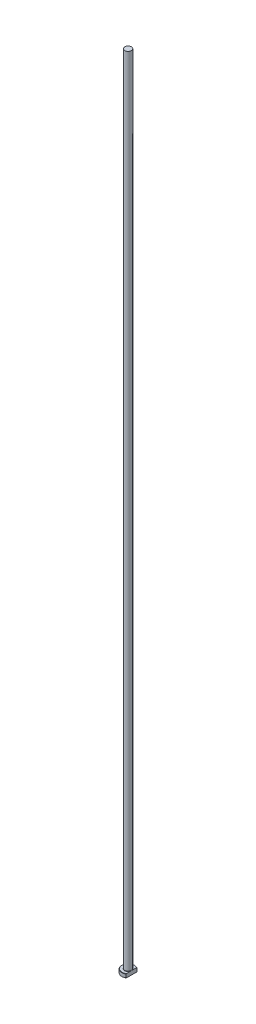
ISO-10303-21;
HEADER;
FILE_DESCRIPTION(('STEP AP214'),'2;1');
FILE_NAME('part.step','',(''),(''),'','','');
FILE_SCHEMA(('AUTOMOTIVE_DESIGN { 1 0 10303 214 1 1 1 1 }'));
ENDSEC;
DATA;
#1=APPLICATION_CONTEXT('core data for automotive mechanical design processes');
#2=APPLICATION_PROTOCOL_DEFINITION('international standard','automotive_design',2000,#1);
#3=PRODUCT_CONTEXT('',#1,'mechanical');
#4=PRODUCT('Part','Part','',(#3));
#5=PRODUCT_RELATED_PRODUCT_CATEGORY('part','',(#4));
#6=PRODUCT_DEFINITION_FORMATION('','',#4);
#7=PRODUCT_DEFINITION_CONTEXT('part definition',#1,'design');
#8=PRODUCT_DEFINITION('design','',#6,#7);
#9=PRODUCT_DEFINITION_SHAPE('','',#8);
#10=(LENGTH_UNIT() NAMED_UNIT(*) SI_UNIT(.MILLI.,.METRE.));
#11=(NAMED_UNIT(*) PLANE_ANGLE_UNIT() SI_UNIT($,.RADIAN.));
#12=(NAMED_UNIT(*) SI_UNIT($,.STERADIAN.) SOLID_ANGLE_UNIT());
#13=UNCERTAINTY_MEASURE_WITH_UNIT(LENGTH_MEASURE(1.E-05),#10,'distance_accuracy_value','');
#14=(GEOMETRIC_REPRESENTATION_CONTEXT(3) GLOBAL_UNCERTAINTY_ASSIGNED_CONTEXT((#13)) GLOBAL_UNIT_ASSIGNED_CONTEXT((#10,
#11,#12)) REPRESENTATION_CONTEXT('',''));
#15=CARTESIAN_POINT('',(0.,0.,0.));
#16=DIRECTION('',(0.,0.,1.));
#17=DIRECTION('',(1.,0.,0.));
#18=AXIS2_PLACEMENT_3D('',#15,#16,#17);
#19=CARTESIAN_POINT('',(0.,0.,0.));
#20=DIRECTION('',(0.,-1.,0.));
#21=DIRECTION('',(0.,0.,-1.));
#22=AXIS2_PLACEMENT_3D('',#19,#20,#21);
#23=PLANE('',#22);
#24=CARTESIAN_POINT('',(0.,0.,0.));
#25=DIRECTION('',(0.,-1.,0.));
#26=DIRECTION('',(0.,0.,-1.));
#27=AXIS2_PLACEMENT_3D('',#24,#25,#26);
#28=CIRCLE('',#27,4.79999999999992);
#29=CARTESIAN_POINT('',(2.59999999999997,0.,4.03484820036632));
#30=VERTEX_POINT('',#29);
#31=CARTESIAN_POINT('',(2.59999999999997,0.,-4.03484820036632));
#32=VERTEX_POINT('',#31);
#33=EDGE_CURVE('E98',#30,#32,#28,.T.);
#34=ORIENTED_EDGE('',*,*,#33,.T.);
#35=DIRECTION('',(0.,0.,1.));
#36=VECTOR('',#35,1.);
#37=CARTESIAN_POINT('',(2.59999999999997,0.,-4.27083130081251));
#38=LINE('',#37,#36);
#39=EDGE_CURVE('E83',#32,#30,#38,.T.);
#40=ORIENTED_EDGE('',*,*,#39,.T.);
#41=EDGE_LOOP('',(#34,#40));
#42=FACE_BOUND('',#41,.T.);
#43=ADVANCED_FACE('F32',(#42),#23,.T.);
#44=CARTESIAN_POINT('',(0.,259.958771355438,0.));
#45=DIRECTION('',(0.,1.,0.));
#46=DIRECTION('',(0.,0.,1.));
#47=AXIS2_PLACEMENT_3D('',#44,#45,#46);
#48=CYLINDRICAL_SURFACE('',#47,4.99999999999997);
#49=CARTESIAN_POINT('',(0.,2.79999999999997,0.));
#50=DIRECTION('',(0.,1.,0.));
#51=DIRECTION('',(0.,0.,1.));
#52=AXIS2_PLACEMENT_3D('',#49,#50,#51);
#53=CIRCLE('',#52,4.99999999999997);
#54=CARTESIAN_POINT('',(2.59999999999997,2.79999999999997,4.27083130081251));
#55=VERTEX_POINT('',#54);
#56=CARTESIAN_POINT('',(2.59999999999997,2.79999999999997,-4.27083130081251));
#57=VERTEX_POINT('',#56);
#58=EDGE_CURVE('E104',#55,#57,#53,.F.);
#59=ORIENTED_EDGE('',*,*,#58,.T.);
#60=DIRECTION('',(0.,-1.,0.));
#61=VECTOR('',#60,1.);
#62=CARTESIAN_POINT('',(2.59999999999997,630.,-4.27083130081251));
#63=LINE('',#62,#61);
#64=CARTESIAN_POINT('',(2.59999999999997,0.200000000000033,-4.27083130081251));
#65=VERTEX_POINT('',#64);
#66=EDGE_CURVE('E183',#57,#65,#63,.T.);
#67=ORIENTED_EDGE('',*,*,#66,.T.);
#68=CARTESIAN_POINT('',(0.,0.200000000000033,0.));
#69=DIRECTION('',(0.,-1.,0.));
#70=DIRECTION('',(0.,0.,-1.));
#71=AXIS2_PLACEMENT_3D('',#68,#69,#70);
#72=CIRCLE('',#71,4.99999999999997);
#73=CARTESIAN_POINT('',(2.59999999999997,0.200000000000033,4.27083130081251));
#74=VERTEX_POINT('',#73);
#75=EDGE_CURVE('E100',#65,#74,#72,.F.);
#76=ORIENTED_EDGE('',*,*,#75,.T.);
#77=DIRECTION('',(0.,-1.,0.));
#78=VECTOR('',#77,1.);
#79=CARTESIAN_POINT('',(2.59999999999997,630.,4.27083130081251));
#80=LINE('',#79,#78);
#81=EDGE_CURVE('E93',#55,#74,#80,.T.);
#82=ORIENTED_EDGE('',*,*,#81,.F.);
#83=EDGE_LOOP('',(#59,#67,#76,#82));
#84=FACE_BOUND('',#83,.T.);
#85=ADVANCED_FACE('F158',(#84),#48,.T.);
#86=CARTESIAN_POINT('',(-4.99999999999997,3.,0.));
#87=DIRECTION('',(0.,1.,0.));
#88=DIRECTION('',(0.,0.,1.));
#89=AXIS2_PLACEMENT_3D('',#86,#87,#88);
#90=PLANE('',#89);
#91=CARTESIAN_POINT('',(0.,3.,0.));
#92=DIRECTION('',(0.,1.,0.));
#93=DIRECTION('',(0.,0.,1.));
#94=AXIS2_PLACEMENT_3D('',#91,#92,#93);
#95=CIRCLE('',#94,4.79999999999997);
#96=CARTESIAN_POINT('',(2.59999999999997,3.,-4.03484820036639));
#97=VERTEX_POINT('',#96);
#98=CARTESIAN_POINT('',(2.59999999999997,3.,4.03484820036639));
#99=VERTEX_POINT('',#98);
#100=EDGE_CURVE('E178',#97,#99,#95,.T.);
#101=ORIENTED_EDGE('',*,*,#100,.T.);
#102=DIRECTION('',(0.,0.,-1.));
#103=VECTOR('',#102,1.);
#104=CARTESIAN_POINT('',(2.59999999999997,3.,0.));
#105=LINE('',#104,#103);
#106=CARTESIAN_POINT('',(2.59999999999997,2.99999999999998,1.03923048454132));
#107=VERTEX_POINT('',#106);
#108=EDGE_CURVE('E57',#99,#107,#105,.T.);
#109=ORIENTED_EDGE('',*,*,#108,.T.);
#110=CARTESIAN_POINT('',(0.,3.,0.));
#111=DIRECTION('',(0.,1.,0.));
#112=DIRECTION('',(0.,0.,1.));
#113=AXIS2_PLACEMENT_3D('',#110,#111,#112);
#114=CIRCLE('',#113,2.79999999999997);
#115=CARTESIAN_POINT('',(2.59999999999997,2.99999999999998,-1.03923048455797));
#116=VERTEX_POINT('',#115);
#117=EDGE_CURVE('E107',#107,#116,#114,.F.);
#118=ORIENTED_EDGE('',*,*,#117,.T.);
#119=EDGE_CURVE('E136',#116,#97,#105,.T.);
#120=ORIENTED_EDGE('',*,*,#119,.T.);
#121=EDGE_LOOP('',(#101,#109,#118,#120));
#122=FACE_BOUND('',#121,.T.);
#123=ADVANCED_FACE('F147',(#122),#90,.T.);
#124=CARTESIAN_POINT('',(0.,3.,0.));
#125=DIRECTION('',(0.,-1.,0.));
#126=DIRECTION('',(0.,0.,-1.));
#127=AXIS2_PLACEMENT_3D('',#124,#125,#126);
#128=CONICAL_SURFACE('',#127,4.79999999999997,0.785398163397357);
#129=ORIENTED_EDGE('',*,*,#58,.F.);
#130=CARTESIAN_POINT('',(2.59999999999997,-1.95047472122,9.397433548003));
#131=CARTESIAN_POINT('',(2.59999999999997,-1.76015203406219,9.19995130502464));
#132=CARTESIAN_POINT('',(2.59999999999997,-1.57004107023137,9.00226440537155));
#133=CARTESIAN_POINT('',(2.59999999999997,-1.19035454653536,8.60637345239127));
#134=CARTESIAN_POINT('',(2.59999999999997,-1.00077899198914,8.4081693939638));
#135=CARTESIAN_POINT('',(2.59999999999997,-0.62220854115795,8.01106626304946));
#136=CARTESIAN_POINT('',(2.59999999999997,-0.433213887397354,7.81216695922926));
#137=CARTESIAN_POINT('',(2.59999999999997,-0.0560371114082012,7.41360059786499));
#138=CARTESIAN_POINT('',(2.59999999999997,0.132145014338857,7.21393354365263));
#139=CARTESIAN_POINT('',(2.59999999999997,0.50431658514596,6.81701377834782));
#140=CARTESIAN_POINT('',(2.59999999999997,0.688323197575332,6.61977717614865));
#141=CARTESIAN_POINT('',(2.59999999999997,1.05506202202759,6.22412305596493));
#142=CARTESIAN_POINT('',(2.59999999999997,1.23779424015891,6.02570554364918));
#143=CARTESIAN_POINT('',(2.59999999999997,1.60155525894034,5.6273713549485));
#144=CARTESIAN_POINT('',(2.59999999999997,1.78258432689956,5.42745492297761));
#145=CARTESIAN_POINT('',(2.59999999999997,2.14238277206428,5.02560172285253));
#146=CARTESIAN_POINT('',(2.59999999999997,2.32115220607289,4.82366500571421));
#147=CARTESIAN_POINT('',(2.59999999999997,2.62527031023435,4.47469662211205));
#148=CARTESIAN_POINT('',(2.59999999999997,2.75138938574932,4.32833728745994));
#149=CARTESIAN_POINT('',(2.59999999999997,3.00151582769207,4.03379615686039));
#150=CARTESIAN_POINT('',(2.59999999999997,3.1255229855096,3.88561418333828));
#151=CARTESIAN_POINT('',(2.59999999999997,3.37190002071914,3.58545728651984));
#152=CARTESIAN_POINT('',(2.59999999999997,3.49424212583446,3.43345946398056));
#153=CARTESIAN_POINT('',(2.59999999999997,3.73490070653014,3.12636139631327));
#154=CARTESIAN_POINT('',(2.59999999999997,3.85321820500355,2.9712619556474));
#155=CARTESIAN_POINT('',(2.59999999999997,4.08579009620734,2.65464223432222));
#156=CARTESIAN_POINT('',(2.59999999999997,4.1999647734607,2.49306256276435));
#157=CARTESIAN_POINT('',(2.59999999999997,4.36468341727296,2.2461359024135));
#158=CARTESIAN_POINT('',(2.59999999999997,4.4185381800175,2.16300143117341));
#159=CARTESIAN_POINT('',(2.59999999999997,4.52346182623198,1.99499855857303));
#160=CARTESIAN_POINT('',(2.59999999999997,4.57453099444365,1.91013033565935));
#161=CARTESIAN_POINT('',(2.59999999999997,4.67263274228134,1.73932569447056));
#162=CARTESIAN_POINT('',(2.59999999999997,4.71970407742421,1.6534118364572));
#163=CARTESIAN_POINT('',(2.59999999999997,4.80952240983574,1.47936505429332));
#164=CARTESIAN_POINT('',(2.59999999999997,4.85226857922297,1.39123170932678));
#165=CARTESIAN_POINT('',(2.59999999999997,4.97211006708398,1.12354274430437));
#166=CARTESIAN_POINT('',(2.59999999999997,5.04118725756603,0.940070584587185));
#167=CARTESIAN_POINT('',(2.59999999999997,5.11752261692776,0.665284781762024));
#168=CARTESIAN_POINT('',(2.59999999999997,5.13802992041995,0.577624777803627));
#169=CARTESIAN_POINT('',(2.59999999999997,5.17073291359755,0.400736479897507));
#170=CARTESIAN_POINT('',(2.59999999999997,5.1829295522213,0.311508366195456));
#171=CARTESIAN_POINT('',(2.59999999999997,5.19813789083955,0.132628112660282));
#172=CARTESIAN_POINT('',(2.59999999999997,5.2011870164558,0.0429792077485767));
#173=CARTESIAN_POINT('',(2.59999999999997,5.19797827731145,-0.136154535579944));
#174=CARTESIAN_POINT('',(2.59999999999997,5.19171987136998,-0.225639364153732));
#175=CARTESIAN_POINT('',(2.59999999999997,5.17043196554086,-0.402893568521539));
#176=CARTESIAN_POINT('',(2.59999999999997,5.15546490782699,-0.490670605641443));
#177=CARTESIAN_POINT('',(2.59999999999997,5.11776551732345,-0.664523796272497));
#178=CARTESIAN_POINT('',(2.59999999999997,5.09503206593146,-0.750599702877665));
#179=CARTESIAN_POINT('',(2.59999999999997,5.04281440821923,-0.921261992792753));
#180=CARTESIAN_POINT('',(2.59999999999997,5.0132872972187,-1.0058350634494));
#181=CARTESIAN_POINT('',(2.59999999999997,4.94875799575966,-1.17281894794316));
#182=CARTESIAN_POINT('',(2.59999999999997,4.91375683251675,-1.25523016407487));
#183=CARTESIAN_POINT('',(2.59999999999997,4.80599778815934,-1.49096020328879));
#184=CARTESIAN_POINT('',(2.59999999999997,4.72750956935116,-1.6416506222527));
#185=CARTESIAN_POINT('',(2.59999999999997,4.55999715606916,-1.93711610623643));
#186=CARTESIAN_POINT('',(2.59999999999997,4.47096030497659,-2.08188377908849));
#187=CARTESIAN_POINT('',(2.59999999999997,4.28541544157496,-2.36729512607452));
#188=CARTESIAN_POINT('',(2.59999999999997,4.18888021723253,-2.50792095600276));
#189=CARTESIAN_POINT('',(2.59999999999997,3.9908534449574,-2.78550445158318));
#190=CARTESIAN_POINT('',(2.59999999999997,3.88936425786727,-2.92246381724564));
#191=CARTESIAN_POINT('',(2.59999999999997,3.68147097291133,-3.19533708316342));
#192=CARTESIAN_POINT('',(2.59999999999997,3.57502092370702,-3.33121580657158));
#193=CARTESIAN_POINT('',(2.59999999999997,3.35937457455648,-3.60078977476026));
#194=CARTESIAN_POINT('',(2.59999999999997,3.250178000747,-3.73448479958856));
#195=CARTESIAN_POINT('',(2.59999999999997,3.02996614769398,-3.99983567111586));
#196=CARTESIAN_POINT('',(2.59999999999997,2.91895572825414,-4.13149556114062));
#197=CARTESIAN_POINT('',(2.59999999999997,2.69532568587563,-4.39344289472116));
#198=CARTESIAN_POINT('',(2.59999999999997,2.58270603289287,-4.52373031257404));
#199=CARTESIAN_POINT('',(2.59999999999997,2.28823888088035,-4.86104966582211));
#200=CARTESIAN_POINT('',(2.59999999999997,2.10540318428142,-5.06721827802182));
#201=CARTESIAN_POINT('',(2.59999999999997,1.73743041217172,-5.47749422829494));
#202=CARTESIAN_POINT('',(2.59999999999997,1.5522932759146,-5.68160151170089));
#203=CARTESIAN_POINT('',(2.59999999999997,1.18015264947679,-6.08844300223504));
#204=CARTESIAN_POINT('',(2.59999999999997,0.993147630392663,-6.29117580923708));
#205=CARTESIAN_POINT('',(2.59999999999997,0.617846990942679,-6.69544313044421));
#206=CARTESIAN_POINT('',(2.59999999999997,0.429551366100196,-6.89697764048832));
#207=CARTESIAN_POINT('',(2.59999999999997,0.0594707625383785,-7.2911039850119));
#208=CARTESIAN_POINT('',(2.59999999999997,-0.12227513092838,-7.48373254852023));
#209=CARTESIAN_POINT('',(2.59999999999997,-0.486506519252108,-7.86829020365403));
#210=CARTESIAN_POINT('',(2.59999999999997,-0.668992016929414,-8.06021929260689));
#211=CARTESIAN_POINT('',(2.59999999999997,-1.03436396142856,-8.44329936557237));
#212=CARTESIAN_POINT('',(2.59999999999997,-1.21724976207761,-8.63445096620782));
#213=CARTESIAN_POINT('',(2.59999999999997,-1.58351605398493,-9.01627657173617));
#214=CARTESIAN_POINT('',(2.59999999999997,-1.76689654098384,-9.20695058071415));
#215=CARTESIAN_POINT('',(2.59999999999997,-1.95047472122,-9.397433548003));
#216=B_SPLINE_CURVE_WITH_KNOTS('',3,(#130,#131,#132,#133,#134,#135,#136,#137,#138,#139,#140,
#141,#142,#143,#144,#145,#146,#147,#148,#149,#150,#151,#152,#153,#154,#155,#156,#157,#158,#159,
#160,#161,#162,#163,#164,#165,#166,#167,#168,#169,#170,#171,#172,#173,#174,#175,#176,#177,#178,
#179,#180,#181,#182,#183,#184,#185,#186,#187,#188,#189,#190,#191,#192,#193,#194,#195,#196,#197,
#198,#199,#200,#201,#202,#203,#204,#205,#206,#207,#208,#209,#210,#211,#212,#213,#214,#215),
.UNSPECIFIED.,.F.,.F.,(4,2,2,2,2,2,2,2,2,2,2,2,2,2,2,2,2,2,2,2,2,2,2,2,2,2,2,2,2,2,2,2,2,2,2,2,
2,2,2,2,2,2,4),(0.,0.822799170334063,1.64560648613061,2.4687202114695,3.29183036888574,
4.10105194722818,4.91026964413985,5.71935814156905,6.52842625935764,7.10801764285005,
7.6876659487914,8.27296873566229,8.85812163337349,9.45143823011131,9.74855643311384,
10.0456442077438,10.3394095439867,10.633231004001,11.2186835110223,11.4884410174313,
11.7581677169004,12.0267893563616,12.2954266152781,12.5621610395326,12.8289338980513,
13.0974401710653,13.3658961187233,13.8748906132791,14.3845021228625,14.8960582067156,
15.4073728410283,15.9251595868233,16.4429981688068,16.9596236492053,17.4762587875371,
18.3029176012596,19.1295982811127,19.9570225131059,20.7844496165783,21.5789508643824,
22.3734551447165,23.1671010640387,23.9607401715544),.UNSPECIFIED.);
#217=EDGE_CURVE('E135',#55,#99,#216,.T.);
#218=ORIENTED_EDGE('',*,*,#217,.T.);
#219=ORIENTED_EDGE('',*,*,#100,.F.);
#220=EDGE_CURVE('E127',#97,#57,#216,.T.);
#221=ORIENTED_EDGE('',*,*,#220,.T.);
#222=EDGE_LOOP('',(#129,#218,#219,#221));
#223=FACE_BOUND('',#222,.T.);
#224=ADVANCED_FACE('F143',(#223),#128,.T.);
#225=CARTESIAN_POINT('',(0.,0.200000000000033,0.));
#226=DIRECTION('',(0.,1.,0.));
#227=DIRECTION('',(0.,0.,1.));
#228=AXIS2_PLACEMENT_3D('',#225,#226,#227);
#229=CONICAL_SURFACE('',#228,4.99999999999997,0.785398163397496);
#230=ORIENTED_EDGE('',*,*,#75,.F.);
#231=CARTESIAN_POINT('',(2.59999999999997,4.95047472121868,-9.397433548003));
#232=CARTESIAN_POINT('',(2.59999999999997,4.76015203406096,-9.19995130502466));
#233=CARTESIAN_POINT('',(2.59999999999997,4.57004107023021,-9.0022644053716));
#234=CARTESIAN_POINT('',(2.59999999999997,4.19035454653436,-8.60637345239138));
#235=CARTESIAN_POINT('',(2.59999999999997,4.00077899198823,-8.40816939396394));
#236=CARTESIAN_POINT('',(2.59999999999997,3.62220854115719,-8.01106626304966));
#237=CARTESIAN_POINT('',(2.59999999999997,3.43321388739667,-7.81216695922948));
#238=CARTESIAN_POINT('',(2.59999999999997,3.05603711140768,-7.41360059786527));
#239=CARTESIAN_POINT('',(2.59999999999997,2.8678549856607,-7.21393354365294));
#240=CARTESIAN_POINT('',(2.59999999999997,2.49568341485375,-6.81701377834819));
#241=CARTESIAN_POINT('',(2.59999999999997,2.31167680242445,-6.61977717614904));
#242=CARTESIAN_POINT('',(2.59999999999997,1.94493797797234,-6.22412305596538));
#243=CARTESIAN_POINT('',(2.59999999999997,1.7622057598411,-6.02570554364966));
#244=CARTESIAN_POINT('',(2.59999999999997,1.39844474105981,-5.62737135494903));
#245=CARTESIAN_POINT('',(2.59999999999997,1.21741567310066,-5.42745492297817));
#246=CARTESIAN_POINT('',(2.59999999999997,0.85761722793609,-5.02560172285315));
#247=CARTESIAN_POINT('',(2.59999999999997,0.678847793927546,-4.82366500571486));
#248=CARTESIAN_POINT('',(2.59999999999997,0.37472968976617,-4.47469662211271));
#249=CARTESIAN_POINT('',(2.59999999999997,0.248610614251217,-4.32833728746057));
#250=CARTESIAN_POINT('',(2.59999999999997,-0.00151582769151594,-4.03379615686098));
#251=CARTESIAN_POINT('',(2.59999999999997,-0.125522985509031,-3.88561418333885));
#252=CARTESIAN_POINT('',(2.59999999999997,-0.371900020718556,-3.58545728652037));
#253=CARTESIAN_POINT('',(2.59999999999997,-0.494242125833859,-3.43345946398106));
#254=CARTESIAN_POINT('',(2.59999999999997,-0.73490070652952,-3.12636139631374));
#255=CARTESIAN_POINT('',(2.59999999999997,-0.853218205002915,-2.97126195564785));
#256=CARTESIAN_POINT('',(2.59999999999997,-1.08579009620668,-2.65464223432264));
#257=CARTESIAN_POINT('',(2.59999999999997,-1.19996477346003,-2.49306256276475));
#258=CARTESIAN_POINT('',(2.59999999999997,-1.36468341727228,-2.24613590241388));
#259=CARTESIAN_POINT('',(2.59999999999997,-1.41853818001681,-2.16300143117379));
#260=CARTESIAN_POINT('',(2.59999999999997,-1.52346182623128,-1.99499855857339));
#261=CARTESIAN_POINT('',(2.59999999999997,-1.57453099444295,-1.9101303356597));
#262=CARTESIAN_POINT('',(2.59999999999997,-1.67263274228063,-1.7393256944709));
#263=CARTESIAN_POINT('',(2.59999999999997,-1.7197040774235,-1.65341183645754));
#264=CARTESIAN_POINT('',(2.59999999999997,-1.80952240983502,-1.47936505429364));
#265=CARTESIAN_POINT('',(2.59999999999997,-1.85226857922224,-1.3912317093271));
#266=CARTESIAN_POINT('',(2.59999999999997,-1.97211006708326,-1.12354274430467));
#267=CARTESIAN_POINT('',(2.59999999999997,-2.0411872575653,-0.940070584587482));
#268=CARTESIAN_POINT('',(2.59999999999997,-2.11752261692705,-0.665284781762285));
#269=CARTESIAN_POINT('',(2.59999999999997,-2.13802992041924,-0.577624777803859));
#270=CARTESIAN_POINT('',(2.59999999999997,-2.17073291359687,-0.400736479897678));
#271=CARTESIAN_POINT('',(2.59999999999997,-2.18292955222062,-0.311508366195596));
#272=CARTESIAN_POINT('',(2.59999999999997,-2.19813789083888,-0.13262811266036));
#273=CARTESIAN_POINT('',(2.59999999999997,-2.20118701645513,-0.0429792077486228));
#274=CARTESIAN_POINT('',(2.59999999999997,-2.19797827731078,0.13615453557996));
#275=CARTESIAN_POINT('',(2.59999999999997,-2.19171987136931,0.225639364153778));
#276=CARTESIAN_POINT('',(2.59999999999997,-2.17043196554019,0.402893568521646));
#277=CARTESIAN_POINT('',(2.59999999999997,-2.15546490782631,0.490670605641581));
#278=CARTESIAN_POINT('',(2.59999999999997,-2.11776551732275,0.664523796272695));
#279=CARTESIAN_POINT('',(2.59999999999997,-2.09503206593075,0.750599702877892));
#280=CARTESIAN_POINT('',(2.59999999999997,-2.04281440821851,0.921261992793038));
#281=CARTESIAN_POINT('',(2.59999999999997,-2.01328729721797,1.00583506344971));
#282=CARTESIAN_POINT('',(2.59999999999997,-1.94875799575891,1.17281894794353));
#283=CARTESIAN_POINT('',(2.59999999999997,-1.91375683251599,1.25523016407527));
#284=CARTESIAN_POINT('',(2.59999999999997,-1.80599778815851,1.49096020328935));
#285=CARTESIAN_POINT('',(2.59999999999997,-1.72750956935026,1.64165062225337));
#286=CARTESIAN_POINT('',(2.59999999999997,-1.55999715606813,1.93711610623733));
#287=CARTESIAN_POINT('',(2.59999999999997,-1.47096030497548,2.08188377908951));
#288=CARTESIAN_POINT('',(2.59999999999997,-1.2854154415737,2.36729512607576));
#289=CARTESIAN_POINT('',(2.59999999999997,-1.1888802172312,2.50792095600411));
#290=CARTESIAN_POINT('',(2.59999999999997,-0.990853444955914,2.78550445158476));
#291=CARTESIAN_POINT('',(2.59999999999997,-0.889364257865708,2.92246381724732));
#292=CARTESIAN_POINT('',(2.59999999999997,-0.681470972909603,3.19533708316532));
#293=CARTESIAN_POINT('',(2.59999999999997,-0.575020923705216,3.3312158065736));
#294=CARTESIAN_POINT('',(2.59999999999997,-0.359374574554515,3.60078977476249));
#295=CARTESIAN_POINT('',(2.59999999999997,-0.25017800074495,3.7344847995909));
#296=CARTESIAN_POINT('',(2.59999999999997,-0.0299661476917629,3.99983567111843));
#297=CARTESIAN_POINT('',(2.59999999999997,0.0810442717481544,4.1314955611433));
#298=CARTESIAN_POINT('',(2.59999999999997,0.30467431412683,4.39344289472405));
#299=CARTESIAN_POINT('',(2.59999999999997,0.417293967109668,4.52373031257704));
#300=CARTESIAN_POINT('',(2.59999999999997,0.711761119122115,4.86104966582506));
#301=CARTESIAN_POINT('',(2.59999999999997,0.894596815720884,5.06721827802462));
#302=CARTESIAN_POINT('',(2.59999999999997,1.26256958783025,5.47749422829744));
#303=CARTESIAN_POINT('',(2.59999999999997,1.4477067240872,5.68160151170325));
#304=CARTESIAN_POINT('',(2.59999999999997,1.81984735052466,6.08844300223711));
#305=CARTESIAN_POINT('',(2.59999999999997,2.00685236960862,6.29117580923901));
#306=CARTESIAN_POINT('',(2.59999999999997,2.38215300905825,6.69544313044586));
#307=CARTESIAN_POINT('',(2.59999999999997,2.57044863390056,6.89697764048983));
#308=CARTESIAN_POINT('',(2.59999999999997,2.94052923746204,7.29110398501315));
#309=CARTESIAN_POINT('',(2.59999999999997,3.12227513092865,7.48373254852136));
#310=CARTESIAN_POINT('',(2.59999999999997,3.48650651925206,7.86829020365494));
#311=CARTESIAN_POINT('',(2.59999999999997,3.66899201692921,8.06021929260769));
#312=CARTESIAN_POINT('',(2.59999999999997,4.03436396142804,8.44329936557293));
#313=CARTESIAN_POINT('',(2.59999999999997,4.21724976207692,8.63445096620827));
#314=CARTESIAN_POINT('',(2.59999999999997,4.58351605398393,9.01627657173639));
#315=CARTESIAN_POINT('',(2.59999999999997,4.76689654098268,9.20695058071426));
#316=CARTESIAN_POINT('',(2.59999999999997,4.95047472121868,9.397433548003));
#317=B_SPLINE_CURVE_WITH_KNOTS('',3,(#231,#232,#233,#234,#235,#236,#237,#238,#239,#240,#241,
#242,#243,#244,#245,#246,#247,#248,#249,#250,#251,#252,#253,#254,#255,#256,#257,#258,#259,#260,
#261,#262,#263,#264,#265,#266,#267,#268,#269,#270,#271,#272,#273,#274,#275,#276,#277,#278,#279,
#280,#281,#282,#283,#284,#285,#286,#287,#288,#289,#290,#291,#292,#293,#294,#295,#296,#297,#298,
#299,#300,#301,#302,#303,#304,#305,#306,#307,#308,#309,#310,#311,#312,#313,#314,#315,#316),
.UNSPECIFIED.,.F.,.F.,(4,2,2,2,2,2,2,2,2,2,2,2,2,2,2,2,2,2,2,2,2,2,2,2,2,2,2,2,2,2,2,2,2,2,2,2,
2,2,2,2,2,2,4),(0.,0.822799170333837,1.64560648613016,2.46872021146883,3.29183036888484,
4.10105194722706,4.91026964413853,5.71935814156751,6.5284262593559,7.10801764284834,
7.68766594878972,8.27296873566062,8.85812163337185,9.45143823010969,9.74855643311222,
10.0456442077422,10.3394095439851,10.6332310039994,11.2186835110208,11.4884410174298,
11.7581677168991,12.0267893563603,12.2954266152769,12.5621610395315,12.8289338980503,
13.0974401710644,13.3658961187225,13.8748906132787,14.3845021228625,14.896058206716,
15.4073728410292,15.9251595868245,16.4429981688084,16.9596236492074,17.4762587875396,
18.3029176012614,19.1295982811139,19.9570225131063,20.7844496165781,21.5789508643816,
22.3734551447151,23.1671010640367,23.9607401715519),.UNSPECIFIED.);
#318=EDGE_CURVE('E86',#65,#32,#317,.T.);
#319=ORIENTED_EDGE('',*,*,#318,.T.);
#320=ORIENTED_EDGE('',*,*,#33,.F.);
#321=EDGE_CURVE('E89',#30,#74,#317,.T.);
#322=ORIENTED_EDGE('',*,*,#321,.T.);
#323=EDGE_LOOP('',(#230,#319,#320,#322));
#324=FACE_BOUND('',#323,.T.);
#325=ADVANCED_FACE('F97',(#324),#229,.T.);
#326=CARTESIAN_POINT('',(0.,3.19999999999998,0.));
#327=DIRECTION('',(0.,1.,0.));
#328=DIRECTION('',(0.,0.,1.));
#329=AXIS2_PLACEMENT_3D('',#326,#327,#328);
#330=TOROIDAL_SURFACE('',#329,2.79999999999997,0.2);
#331=CARTESIAN_POINT('',(2.59999999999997,3.19999999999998,0.));
#332=CARTESIAN_POINT('',(2.59999999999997,3.20000050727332,1.23579409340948E-10));
#333=CARTESIAN_POINT('',(2.59999999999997,3.20000101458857,-1.74789552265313E-07));
#334=CARTESIAN_POINT('',(2.59999999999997,3.20000196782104,-6.73287793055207E-07));
#335=CARTESIAN_POINT('',(2.59999999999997,3.20000240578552,-1.00747163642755E-06));
#336=CARTESIAN_POINT('',(2.59999999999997,3.20000330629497,-1.80604944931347E-06));
#337=CARTESIAN_POINT('',(2.59999999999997,3.20000375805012,-2.28310921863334E-06));
#338=CARTESIAN_POINT('',(2.59999999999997,3.20000457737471,-3.28018171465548E-06));
#339=CARTESIAN_POINT('',(2.59999999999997,3.20000494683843,-3.79874305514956E-06));
#340=CARTESIAN_POINT('',(2.59999999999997,3.20000629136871,-5.77594334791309E-06));
#341=CARTESIAN_POINT('',(2.59999999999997,3.20000719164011,-7.28765589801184E-06));
#342=CARTESIAN_POINT('',(2.59999999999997,3.20000869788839,-1.03067582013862E-05));
#343=CARTESIAN_POINT('',(2.59999999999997,3.20000932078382,-1.18060929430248E-05));
#344=CARTESIAN_POINT('',(2.59999999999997,3.20001188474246,-1.80612988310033E-05));
#345=CARTESIAN_POINT('',(2.59999999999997,3.20001376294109,-2.28467812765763E-05));
#346=CARTESIAN_POINT('',(2.59999999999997,3.20001657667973,-3.19530305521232E-05));
#347=CARTESIAN_POINT('',(2.59999999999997,3.20001760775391,-3.62442681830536E-05));
#348=CARTESIAN_POINT('',(2.59999999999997,3.20002504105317,-6.7868346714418E-05));
#349=CARTESIAN_POINT('',(2.59999999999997,3.20003059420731,-9.53536176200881E-05));
#350=CARTESIAN_POINT('',(2.59999999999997,3.20005490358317,-0.000203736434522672));
#351=CARTESIAN_POINT('',(2.59999999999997,3.20007818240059,-0.000283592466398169));
#352=CARTESIAN_POINT('',(2.59999999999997,3.2001686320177,-0.000599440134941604));
#353=CARTESIAN_POINT('',(2.59999999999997,3.2002328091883,-0.000836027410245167));
#354=CARTESIAN_POINT('',(2.59999999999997,3.20048945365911,-0.00177477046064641));
#355=CARTESIAN_POINT('',(2.59999999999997,3.20068565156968,-0.00247616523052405));
#356=CARTESIAN_POINT('',(2.59999999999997,3.20149940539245,-0.0053934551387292));
#357=CARTESIAN_POINT('',(2.59999999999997,3.20211229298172,-0.007610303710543));
#358=CARTESIAN_POINT('',(2.59999999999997,3.2076646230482,-0.0276831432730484));
#359=CARTESIAN_POINT('',(2.59999999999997,3.21262302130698,-0.0455354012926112));
#360=CARTESIAN_POINT('',(2.59999999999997,3.22230897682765,-0.0805439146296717));
#361=CARTESIAN_POINT('',(2.59999999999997,3.22703791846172,-0.0976998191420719));
#362=CARTESIAN_POINT('',(2.59999999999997,3.23705035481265,-0.134181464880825));
#363=CARTESIAN_POINT('',(2.59999999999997,3.2423287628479,-0.153508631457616));
#364=CARTESIAN_POINT('',(2.59999999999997,3.25286316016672,-0.192393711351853));
#365=CARTESIAN_POINT('',(2.59999999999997,3.25811828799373,-0.211951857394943));
#366=CARTESIAN_POINT('',(2.59999999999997,3.27070509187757,-0.259316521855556));
#367=CARTESIAN_POINT('',(2.59999999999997,3.27798202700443,-0.287137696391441));
#368=CARTESIAN_POINT('',(2.59999999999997,3.29204094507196,-0.342105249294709));
#369=CARTESIAN_POINT('',(2.59999999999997,3.29883098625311,-0.36924957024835));
#370=CARTESIAN_POINT('',(2.59999999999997,3.32069835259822,-0.459246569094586));
#371=CARTESIAN_POINT('',(2.59999999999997,3.33498012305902,-0.522296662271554));
#372=CARTESIAN_POINT('',(2.59999999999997,3.36056532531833,-0.649787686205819));
#373=CARTESIAN_POINT('',(2.59999999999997,3.37183254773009,-0.714236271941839));
#374=CARTESIAN_POINT('',(2.59999999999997,3.38542084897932,-0.81395858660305));
#375=CARTESIAN_POINT('',(2.59999999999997,3.38947199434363,-0.84899397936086));
#376=CARTESIAN_POINT('',(2.59999999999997,3.39578733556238,-0.91922149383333));
#377=CARTESIAN_POINT('',(2.59999999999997,3.39805216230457,-0.954413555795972));
#378=CARTESIAN_POINT('',(2.59999999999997,3.40031330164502,-1.02465521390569));
#379=CARTESIAN_POINT('',(2.59999999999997,3.40032384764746,-1.05970430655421));
#380=CARTESIAN_POINT('',(2.59999999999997,3.39745377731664,-1.1296713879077));
#381=CARTESIAN_POINT('',(2.59999999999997,3.39457726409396,-1.16458949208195));
#382=CARTESIAN_POINT('',(2.59999999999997,3.38762659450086,-1.21434358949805));
#383=CARTESIAN_POINT('',(2.59999999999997,3.3851418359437,-1.22940327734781));
#384=CARTESIAN_POINT('',(2.59999999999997,3.37928992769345,-1.25936829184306));
#385=CARTESIAN_POINT('',(2.59999999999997,3.37592199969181,-1.27427347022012));
#386=CARTESIAN_POINT('',(2.59999999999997,3.36819593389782,-1.30360801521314));
#387=CARTESIAN_POINT('',(2.59999999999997,3.36385215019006,-1.31804111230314));
#388=CARTESIAN_POINT('',(2.59999999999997,3.35394180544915,-1.34647366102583));
#389=CARTESIAN_POINT('',(2.59999999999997,3.34837682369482,-1.36047364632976));
#390=CARTESIAN_POINT('',(2.59999999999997,3.3378467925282,-1.3832098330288));
#391=CARTESIAN_POINT('',(2.59999999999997,3.33330355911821,-1.39214053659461));
#392=CARTESIAN_POINT('',(2.59999999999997,3.32341812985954,-1.40958482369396));
#393=CARTESIAN_POINT('',(2.59999999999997,3.31807401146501,-1.41809733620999));
#394=CARTESIAN_POINT('',(2.59999999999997,3.3064185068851,-1.43453575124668));
#395=CARTESIAN_POINT('',(2.59999999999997,3.30010038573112,-1.44245695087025));
#396=CARTESIAN_POINT('',(2.59999999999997,3.28637957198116,-1.45729976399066));
#397=CARTESIAN_POINT('',(2.59999999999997,3.27897945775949,-1.46422367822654));
#398=CARTESIAN_POINT('',(2.59999999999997,3.26567821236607,-1.47448129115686));
#399=CARTESIAN_POINT('',(2.59999999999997,3.26010727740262,-1.47824010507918));
#400=CARTESIAN_POINT('',(2.59999999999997,3.24845655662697,-1.48487520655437));
#401=CARTESIAN_POINT('',(2.59999999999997,3.24237710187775,-1.4877520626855));
#402=CARTESIAN_POINT('',(2.59999999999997,3.22972757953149,-1.49241784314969));
#403=CARTESIAN_POINT('',(2.59999999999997,3.22315282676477,-1.49419437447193));
#404=CARTESIAN_POINT('',(2.59999999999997,3.20978231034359,-1.49640812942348));
#405=CARTESIAN_POINT('',(2.59999999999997,3.20298682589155,-1.49684698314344));
#406=CARTESIAN_POINT('',(2.59999999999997,3.19037691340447,-1.49637060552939));
#407=CARTESIAN_POINT('',(2.59999999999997,3.18455503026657,-1.49563180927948));
#408=CARTESIAN_POINT('',(2.59999999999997,3.17311801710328,-1.49319000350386));
#409=CARTESIAN_POINT('',(2.59999999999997,3.1675030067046,-1.49148644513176));
#410=CARTESIAN_POINT('',(2.59999999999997,3.15514195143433,-1.48668054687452));
#411=CARTESIAN_POINT('',(2.59999999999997,3.14849468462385,-1.48332605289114));
#412=CARTESIAN_POINT('',(2.59999999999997,3.13582833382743,-1.47559145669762));
#413=CARTESIAN_POINT('',(2.59999999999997,3.12981053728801,-1.47120930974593));
#414=CARTESIAN_POINT('',(2.59999999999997,3.11535552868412,-1.45914343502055));
#415=CARTESIAN_POINT('',(2.59999999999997,3.10734855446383,-1.45094839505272));
#416=CARTESIAN_POINT('',(2.59999999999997,3.09265977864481,-1.43346680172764));
#417=CARTESIAN_POINT('',(2.59999999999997,3.08598026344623,-1.4241784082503));
#418=CARTESIAN_POINT('',(2.59999999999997,3.06857102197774,-1.39681642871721));
#419=CARTESIAN_POINT('',(2.59999999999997,3.05915220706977,-1.37791719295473));
#420=CARTESIAN_POINT('',(2.59999999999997,3.04297062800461,-1.3389290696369));
#421=CARTESIAN_POINT('',(2.59999999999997,3.03622846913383,-1.31883227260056));
#422=CARTESIAN_POINT('',(2.59999999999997,3.02432998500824,-1.27632728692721));
#423=CARTESIAN_POINT('',(2.59999999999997,3.01935848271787,-1.25386836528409));
#424=CARTESIAN_POINT('',(2.59999999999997,3.01130018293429,-1.20858750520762));
#425=CARTESIAN_POINT('',(2.59999999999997,3.00821705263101,-1.18576494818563));
#426=CARTESIAN_POINT('',(2.59999999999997,3.00363796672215,-1.1405967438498));
#427=CARTESIAN_POINT('',(2.59999999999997,3.00210096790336,-1.11825509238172));
#428=CARTESIAN_POINT('',(2.59999999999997,3.00022491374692,-1.07361049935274));
#429=CARTESIAN_POINT('',(2.59999999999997,2.99988136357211,-1.05130772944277));
#430=CARTESIAN_POINT('',(2.59999999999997,3.00029323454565,-0.991792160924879));
#431=CARTESIAN_POINT('',(2.59999999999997,3.00193756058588,-0.954585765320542));
#432=CARTESIAN_POINT('',(2.59999999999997,3.00736147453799,-0.880345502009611));
#433=CARTESIAN_POINT('',(2.59999999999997,3.01114096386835,-0.843311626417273));
#434=CARTESIAN_POINT('',(2.59999999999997,3.02049059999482,-0.768589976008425));
#435=CARTESIAN_POINT('',(2.59999999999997,3.02610078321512,-0.730907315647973));
#436=CARTESIAN_POINT('',(2.59999999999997,3.0387231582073,-0.655686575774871));
#437=CARTESIAN_POINT('',(2.59999999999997,3.0457387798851,-0.618149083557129));
#438=CARTESIAN_POINT('',(2.59999999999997,3.06358120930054,-0.52980872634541));
#439=CARTESIAN_POINT('',(2.59999999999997,3.07487037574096,-0.479100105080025));
#440=CARTESIAN_POINT('',(2.59999999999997,3.09870164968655,-0.378576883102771));
#441=CARTESIAN_POINT('',(2.59999999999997,3.1112285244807,-0.328758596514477));
#442=CARTESIAN_POINT('',(2.59999999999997,3.13564556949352,-0.234990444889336));
#443=CARTESIAN_POINT('',(2.59999999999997,3.14744634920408,-0.191016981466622));
#444=CARTESIAN_POINT('',(2.59999999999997,3.17192746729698,-0.101304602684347));
#445=CARTESIAN_POINT('',(2.59999999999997,3.18462387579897,-0.0555700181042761));
#446=CARTESIAN_POINT('',(2.59999999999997,3.19788889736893,-0.00760560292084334));
#447=CARTESIAN_POINT('',(2.59999999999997,3.19850316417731,-0.00538409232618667));
#448=CARTESIAN_POINT('',(2.59999999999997,3.19931724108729,-0.00246573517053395));
#449=CARTESIAN_POINT('',(2.59999999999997,3.19951242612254,-0.00176794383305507));
#450=CARTESIAN_POINT('',(2.59999999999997,3.19976783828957,-0.000833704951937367));
#451=CARTESIAN_POINT('',(2.59999999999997,3.19983177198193,-0.000598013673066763));
#452=CARTESIAN_POINT('',(2.59999999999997,3.19992192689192,-0.000283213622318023));
#453=CARTESIAN_POINT('',(2.59999999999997,3.19994516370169,-0.00020351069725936));
#454=CARTESIAN_POINT('',(2.59999999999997,3.19996943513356,-9.53048357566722E-05));
#455=CARTESIAN_POINT('',(2.59999999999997,3.19997498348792,-6.78414250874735E-05));
#456=CARTESIAN_POINT('',(2.59999999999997,3.1999824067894,-3.62395621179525E-05));
#457=CARTESIAN_POINT('',(2.59999999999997,3.19998343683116,-3.19495761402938E-05));
#458=CARTESIAN_POINT('',(2.59999999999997,3.19998624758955,-2.2845859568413E-05));
#459=CARTESIAN_POINT('',(2.59999999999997,3.19998812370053,-1.80615919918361E-05));
#460=CARTESIAN_POINT('',(2.59999999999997,3.19999068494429,-1.18076342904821E-05));
#461=CARTESIAN_POINT('',(2.59999999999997,3.19999130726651,-1.03083932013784E-05));
#462=CARTESIAN_POINT('',(2.59999999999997,3.19999281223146,-7.28938063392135E-06));
#463=CARTESIAN_POINT('',(2.59999999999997,3.19999371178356,-5.77765312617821E-06));
#464=CARTESIAN_POINT('',(2.59999999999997,3.19999505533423,-3.80031827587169E-06));
#465=CARTESIAN_POINT('',(2.59999999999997,3.19999542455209,-3.28169096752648E-06));
#466=CARTESIAN_POINT('',(2.59999999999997,3.19999624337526,-2.28444217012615E-06));
#467=CARTESIAN_POINT('',(2.59999999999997,3.19999669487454,-1.80727069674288E-06));
#468=CARTESIAN_POINT('',(2.59999999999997,3.19999759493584,-1.00842880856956E-06));
#469=CARTESIAN_POINT('',(2.59999999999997,3.19999803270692,-6.74101888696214E-07));
#470=CARTESIAN_POINT('',(2.59999999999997,3.19999898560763,-1.75245051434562E-07));
#471=CARTESIAN_POINT('',(2.59999999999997,3.19999949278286,-1.23565714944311E-10));
#472=CARTESIAN_POINT('',(2.59999999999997,3.19999999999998,0.));
#473=B_SPLINE_CURVE_WITH_KNOTS('',3,(#331,#332,#333,#334,#335,#336,#337,#338,#339,#340,#341,
#342,#343,#344,#345,#346,#347,#348,#349,#350,#351,#352,#353,#354,#355,#356,#357,#358,#359,#360,
#361,#362,#363,#364,#365,#366,#367,#368,#369,#370,#371,#372,#373,#374,#375,#376,#377,#378,#379,
#380,#381,#382,#383,#384,#385,#386,#387,#388,#389,#390,#391,#392,#393,#394,#395,#396,#397,#398,
#399,#400,#401,#402,#403,#404,#405,#406,#407,#408,#409,#410,#411,#412,#413,#414,#415,#416,#417,
#418,#419,#420,#421,#422,#423,#424,#425,#426,#427,#428,#429,#430,#431,#432,#433,#434,#435,#436,
#437,#438,#439,#440,#441,#442,#443,#444,#445,#446,#447,#448,#449,#450,#451,#452,#453,#454,#455,
#456,#457,#458,#459,#460,#461,#462,#463,#464,#465,#466,#467,#468,#469,#470,#471,#472),
.UNSPECIFIED.,.T.,.F.,(4,2,2,2,2,2,2,2,2,2,2,2,2,2,2,2,2,2,2,2,2,2,2,2,2,2,2,2,2,2,2,2,2,2,2,2,
2,2,2,2,2,2,2,2,2,2,2,2,2,2,2,2,2,2,2,2,2,2,2,2,2,2,2,2,2,2,2,2,2,2,4),(0.,1.53042757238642E-06,
3.18106748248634E-06,5.14121990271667E-06,7.05005828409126E-06,1.23079983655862E-05,
1.7174539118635E-05,3.25667081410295E-05,4.57900795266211E-05,0.00012992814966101,
0.00037919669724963,0.00111488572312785,0.00329950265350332,0.0101999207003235,
0.0657821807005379,0.119169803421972,0.179274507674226,0.24002995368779,0.326299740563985,
0.410240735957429,0.6041400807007,0.800273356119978,0.906045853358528,1.01178097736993,
1.1168484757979,1.22176686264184,1.26753679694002,1.31334720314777,1.35852340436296,
1.40364152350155,1.43367014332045,1.46377203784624,1.49409227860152,1.52434140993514,
1.54444068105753,1.56452696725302,1.58483555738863,1.6051193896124,1.62263810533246,
1.64016679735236,1.66238011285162,1.6846380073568,1.71881594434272,1.75305224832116,
1.81604715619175,1.87951801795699,1.94841441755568,2.01744419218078,2.08458891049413,
2.15148046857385,2.26311962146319,2.37475362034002,2.48901400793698,2.60355671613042,
2.75937570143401,2.91347192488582,3.0500585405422,3.19244561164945,3.19936059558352,
3.20153398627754,3.20226688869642,3.20251568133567,3.2025997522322,3.20261297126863,
3.20262835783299,3.20263322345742,3.20263848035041,3.20264038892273,3.2026423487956,
3.20264399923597,3.20264552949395),.UNSPECIFIED.);
#474=CARTESIAN_POINT('',(2.59999999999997,3.19999999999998,0.));
#475=VERTEX_POINT('',#474);
#476=EDGE_CURVE('E11',#116,#475,#473,.T.);
#477=ORIENTED_EDGE('',*,*,#476,.F.);
#478=ORIENTED_EDGE('',*,*,#117,.F.);
#479=CARTESIAN_POINT('',(2.59999999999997,3.19999999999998,0.));
#480=CARTESIAN_POINT('',(2.59999999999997,3.19999949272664,-1.23579435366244E-10));
#481=CARTESIAN_POINT('',(2.59999999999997,3.19999898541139,1.74789552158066E-07));
#482=CARTESIAN_POINT('',(2.59999999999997,3.19999803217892,6.73287792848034E-07));
#483=CARTESIAN_POINT('',(2.59999999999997,3.19999759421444,1.00747163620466E-06));
#484=CARTESIAN_POINT('',(2.59999999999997,3.19999669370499,1.80604944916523E-06));
#485=CARTESIAN_POINT('',(2.59999999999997,3.19999624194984,2.28310921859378E-06));
#486=CARTESIAN_POINT('',(2.59999999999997,3.19999542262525,3.28018171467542E-06));
#487=CARTESIAN_POINT('',(2.59999999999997,3.19999505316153,3.79874305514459E-06));
#488=CARTESIAN_POINT('',(2.59999999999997,3.19999370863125,5.77594334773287E-06));
#489=CARTESIAN_POINT('',(2.59999999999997,3.19999280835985,7.28765589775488E-06));
#490=CARTESIAN_POINT('',(2.59999999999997,3.19999130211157,1.03067582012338E-05));
#491=CARTESIAN_POINT('',(2.59999999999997,3.19999067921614,1.18060929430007E-05));
#492=CARTESIAN_POINT('',(2.59999999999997,3.1999881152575,1.80612988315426E-05));
#493=CARTESIAN_POINT('',(2.59999999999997,3.19998623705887,2.28467812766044E-05));
#494=CARTESIAN_POINT('',(2.59999999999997,3.19998342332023,3.19530305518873E-05));
#495=CARTESIAN_POINT('',(2.59999999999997,3.19998239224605,3.62442681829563E-05));
#496=CARTESIAN_POINT('',(2.59999999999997,3.19997495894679,6.78683467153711E-05));
#497=CARTESIAN_POINT('',(2.59999999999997,3.19996940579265,9.53536176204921E-05));
#498=CARTESIAN_POINT('',(2.59999999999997,3.19994509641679,0.000203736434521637));
#499=CARTESIAN_POINT('',(2.59999999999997,3.19992181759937,0.000283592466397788));
#500=CARTESIAN_POINT('',(2.59999999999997,3.19983136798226,0.000599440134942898));
#501=CARTESIAN_POINT('',(2.59999999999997,3.19976719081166,0.000836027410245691));
#502=CARTESIAN_POINT('',(2.59999999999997,3.19951054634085,0.00177477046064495));
#503=CARTESIAN_POINT('',(2.59999999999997,3.19931434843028,0.00247616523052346));
#504=CARTESIAN_POINT('',(2.59999999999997,3.19850059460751,0.00539345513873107));
#505=CARTESIAN_POINT('',(2.59999999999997,3.19788770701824,0.00761030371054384));
#506=CARTESIAN_POINT('',(2.59999999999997,3.19233537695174,0.0276831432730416));
#507=CARTESIAN_POINT('',(2.59999999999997,3.18737697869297,0.0455354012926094));
#508=CARTESIAN_POINT('',(2.59999999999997,3.17769102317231,0.0805439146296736));
#509=CARTESIAN_POINT('',(2.59999999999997,3.17296208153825,0.0976998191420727));
#510=CARTESIAN_POINT('',(2.59999999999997,3.16294964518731,0.134181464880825));
#511=CARTESIAN_POINT('',(2.59999999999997,3.15767123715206,0.153508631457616));
#512=CARTESIAN_POINT('',(2.59999999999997,3.14713683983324,0.192393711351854));
#513=CARTESIAN_POINT('',(2.59999999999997,3.14188171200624,0.211951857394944));
#514=CARTESIAN_POINT('',(2.59999999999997,3.12929490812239,0.259316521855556));
#515=CARTESIAN_POINT('',(2.59999999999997,3.12201797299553,0.287137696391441));
#516=CARTESIAN_POINT('',(2.59999999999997,3.107959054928,0.342105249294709));
#517=CARTESIAN_POINT('',(2.59999999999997,3.10116901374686,0.36924957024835));
#518=CARTESIAN_POINT('',(2.59999999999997,3.07930164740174,0.459246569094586));
#519=CARTESIAN_POINT('',(2.59999999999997,3.06501987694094,0.522296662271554));
#520=CARTESIAN_POINT('',(2.59999999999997,3.03943467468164,0.649787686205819));
#521=CARTESIAN_POINT('',(2.59999999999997,3.02816745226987,0.714236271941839));
#522=CARTESIAN_POINT('',(2.59999999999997,3.01457915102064,0.81395858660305));
#523=CARTESIAN_POINT('',(2.59999999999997,3.01052800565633,0.84899397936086));
#524=CARTESIAN_POINT('',(2.59999999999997,3.00421266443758,0.91922149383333));
#525=CARTESIAN_POINT('',(2.59999999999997,3.00194783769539,0.954413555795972));
#526=CARTESIAN_POINT('',(2.59999999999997,2.99968669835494,1.02465521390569));
#527=CARTESIAN_POINT('',(2.59999999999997,2.9996761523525,1.05970430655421));
#528=CARTESIAN_POINT('',(2.59999999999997,3.00254622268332,1.1296713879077));
#529=CARTESIAN_POINT('',(2.59999999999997,3.005422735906,1.16458949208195));
#530=CARTESIAN_POINT('',(2.59999999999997,3.0123734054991,1.21434358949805));
#531=CARTESIAN_POINT('',(2.59999999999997,3.01485816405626,1.22940327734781));
#532=CARTESIAN_POINT('',(2.59999999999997,3.02071007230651,1.25936829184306));
#533=CARTESIAN_POINT('',(2.59999999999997,3.02407800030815,1.27427347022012));
#534=CARTESIAN_POINT('',(2.59999999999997,3.03180406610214,1.30360801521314));
#535=CARTESIAN_POINT('',(2.59999999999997,3.0361478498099,1.31804111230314));
#536=CARTESIAN_POINT('',(2.59999999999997,3.04605819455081,1.34647366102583));
#537=CARTESIAN_POINT('',(2.59999999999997,3.05162317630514,1.36047364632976));
#538=CARTESIAN_POINT('',(2.59999999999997,3.06215320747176,1.3832098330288));
#539=CARTESIAN_POINT('',(2.59999999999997,3.06669644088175,1.39214053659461));
#540=CARTESIAN_POINT('',(2.59999999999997,3.07658187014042,1.40958482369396));
#541=CARTESIAN_POINT('',(2.59999999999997,3.08192598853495,1.41809733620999));
#542=CARTESIAN_POINT('',(2.59999999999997,3.09358149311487,1.43453575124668));
#543=CARTESIAN_POINT('',(2.59999999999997,3.09989961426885,1.44245695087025));
#544=CARTESIAN_POINT('',(2.59999999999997,3.11362042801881,1.45729976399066));
#545=CARTESIAN_POINT('',(2.59999999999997,3.12102054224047,1.46422367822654));
#546=CARTESIAN_POINT('',(2.59999999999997,3.13432178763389,1.47448129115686));
#547=CARTESIAN_POINT('',(2.59999999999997,3.13989272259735,1.47824010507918));
#548=CARTESIAN_POINT('',(2.59999999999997,3.15154344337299,1.48487520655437));
#549=CARTESIAN_POINT('',(2.59999999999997,3.15762289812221,1.4877520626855));
#550=CARTESIAN_POINT('',(2.59999999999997,3.17027242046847,1.49241784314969));
#551=CARTESIAN_POINT('',(2.59999999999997,3.17684717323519,1.49419437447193));
#552=CARTESIAN_POINT('',(2.59999999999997,3.19021768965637,1.49640812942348));
#553=CARTESIAN_POINT('',(2.59999999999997,3.19701317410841,1.49684698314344));
#554=CARTESIAN_POINT('',(2.59999999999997,3.20962308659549,1.49637060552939));
#555=CARTESIAN_POINT('',(2.59999999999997,3.21544496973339,1.49563180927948));
#556=CARTESIAN_POINT('',(2.59999999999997,3.22688198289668,1.49319000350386));
#557=CARTESIAN_POINT('',(2.59999999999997,3.23249699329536,1.49148644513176));
#558=CARTESIAN_POINT('',(2.59999999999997,3.24485804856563,1.48668054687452));
#559=CARTESIAN_POINT('',(2.59999999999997,3.25150531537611,1.48332605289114));
#560=CARTESIAN_POINT('',(2.59999999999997,3.26417166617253,1.47559145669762));
#561=CARTESIAN_POINT('',(2.59999999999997,3.27018946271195,1.47120930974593));
#562=CARTESIAN_POINT('',(2.59999999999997,3.28464447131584,1.45914343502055));
#563=CARTESIAN_POINT('',(2.59999999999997,3.29265144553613,1.45094839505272));
#564=CARTESIAN_POINT('',(2.59999999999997,3.30734022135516,1.43346680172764));
#565=CARTESIAN_POINT('',(2.59999999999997,3.31401973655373,1.4241784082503));
#566=CARTESIAN_POINT('',(2.59999999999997,3.33142897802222,1.39681642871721));
#567=CARTESIAN_POINT('',(2.59999999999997,3.34084779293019,1.37791719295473));
#568=CARTESIAN_POINT('',(2.59999999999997,3.35702937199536,1.3389290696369));
#569=CARTESIAN_POINT('',(2.59999999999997,3.36377153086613,1.31883227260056));
#570=CARTESIAN_POINT('',(2.59999999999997,3.37567001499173,1.27632728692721));
#571=CARTESIAN_POINT('',(2.59999999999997,3.38064151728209,1.25386836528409));
#572=CARTESIAN_POINT('',(2.59999999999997,3.38869981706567,1.20858750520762));
#573=CARTESIAN_POINT('',(2.59999999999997,3.39178294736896,1.18576494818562));
#574=CARTESIAN_POINT('',(2.59999999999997,3.39636203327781,1.1405967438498));
#575=CARTESIAN_POINT('',(2.59999999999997,3.39789903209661,1.11825509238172));
#576=CARTESIAN_POINT('',(2.59999999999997,3.39977508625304,1.07361049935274));
#577=CARTESIAN_POINT('',(2.59999999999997,3.40011863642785,1.05130772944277));
#578=CARTESIAN_POINT('',(2.59999999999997,3.39970676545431,0.991792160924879));
#579=CARTESIAN_POINT('',(2.59999999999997,3.39806243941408,0.954585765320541));
#580=CARTESIAN_POINT('',(2.59999999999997,3.39263852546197,0.880345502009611));
#581=CARTESIAN_POINT('',(2.59999999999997,3.38885903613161,0.843311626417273));
#582=CARTESIAN_POINT('',(2.59999999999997,3.37950940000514,0.768589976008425));
#583=CARTESIAN_POINT('',(2.59999999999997,3.37389921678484,0.730907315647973));
#584=CARTESIAN_POINT('',(2.59999999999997,3.36127684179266,0.655686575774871));
#585=CARTESIAN_POINT('',(2.59999999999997,3.35426122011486,0.618149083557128));
#586=CARTESIAN_POINT('',(2.59999999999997,3.33641879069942,0.52980872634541));
#587=CARTESIAN_POINT('',(2.59999999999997,3.325129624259,0.479100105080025));
#588=CARTESIAN_POINT('',(2.59999999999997,3.30129835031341,0.378576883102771));
#589=CARTESIAN_POINT('',(2.59999999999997,3.28877147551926,0.328758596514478));
#590=CARTESIAN_POINT('',(2.59999999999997,3.26435443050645,0.234990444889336));
#591=CARTESIAN_POINT('',(2.59999999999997,3.25255365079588,0.19101698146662));
#592=CARTESIAN_POINT('',(2.59999999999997,3.22807253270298,0.101304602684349));
#593=CARTESIAN_POINT('',(2.59999999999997,3.21537612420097,0.0555700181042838));
#594=CARTESIAN_POINT('',(2.59999999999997,3.20211110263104,0.007605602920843));
#595=CARTESIAN_POINT('',(2.59999999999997,3.20149683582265,0.00538409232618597));
#596=CARTESIAN_POINT('',(2.59999999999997,3.20068275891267,0.00246573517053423));
#597=CARTESIAN_POINT('',(2.59999999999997,3.20048757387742,0.00176794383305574));
#598=CARTESIAN_POINT('',(2.59999999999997,3.20023216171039,0.000833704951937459));
#599=CARTESIAN_POINT('',(2.59999999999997,3.20016822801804,0.000598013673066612));
#600=CARTESIAN_POINT('',(2.59999999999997,3.20007807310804,0.000283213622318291));
#601=CARTESIAN_POINT('',(2.59999999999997,3.20005483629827,0.000203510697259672));
#602=CARTESIAN_POINT('',(2.59999999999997,3.20003056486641,9.53048357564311E-05));
#603=CARTESIAN_POINT('',(2.59999999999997,3.20002501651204,6.78414250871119E-05));
#604=CARTESIAN_POINT('',(2.59999999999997,3.20001759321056,3.62395621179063E-05));
#605=CARTESIAN_POINT('',(2.59999999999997,3.2000165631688,3.19495761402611E-05));
#606=CARTESIAN_POINT('',(2.59999999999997,3.20001375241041,2.28458595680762E-05));
#607=CARTESIAN_POINT('',(2.59999999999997,3.20001187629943,1.80615919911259E-05));
#608=CARTESIAN_POINT('',(2.59999999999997,3.20000931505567,1.18076342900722E-05));
#609=CARTESIAN_POINT('',(2.59999999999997,3.20000869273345,1.03083932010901E-05));
#610=CARTESIAN_POINT('',(2.59999999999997,3.2000071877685,7.28938063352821E-06));
#611=CARTESIAN_POINT('',(2.59999999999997,3.2000062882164,5.77765312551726E-06));
#612=CARTESIAN_POINT('',(2.59999999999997,3.20000494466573,3.80031827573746E-06));
#613=CARTESIAN_POINT('',(2.59999999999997,3.20000457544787,3.28169096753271E-06));
#614=CARTESIAN_POINT('',(2.59999999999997,3.2000037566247,2.28444217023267E-06));
#615=CARTESIAN_POINT('',(2.59999999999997,3.20000330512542,1.80727069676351E-06));
#616=CARTESIAN_POINT('',(2.59999999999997,3.20000240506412,1.00842880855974E-06));
#617=CARTESIAN_POINT('',(2.59999999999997,3.20000196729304,6.7410188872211E-07));
#618=CARTESIAN_POINT('',(2.59999999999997,3.20000101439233,1.75245051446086E-07));
#619=CARTESIAN_POINT('',(2.59999999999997,3.20000050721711,1.23565740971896E-10));
#620=CARTESIAN_POINT('',(2.59999999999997,3.19999999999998,0.));
#621=B_SPLINE_CURVE_WITH_KNOTS('',3,(#479,#480,#481,#482,#483,#484,#485,#486,#487,#488,#489,
#490,#491,#492,#493,#494,#495,#496,#497,#498,#499,#500,#501,#502,#503,#504,#505,#506,#507,#508,
#509,#510,#511,#512,#513,#514,#515,#516,#517,#518,#519,#520,#521,#522,#523,#524,#525,#526,#527,
#528,#529,#530,#531,#532,#533,#534,#535,#536,#537,#538,#539,#540,#541,#542,#543,#544,#545,#546,
#547,#548,#549,#550,#551,#552,#553,#554,#555,#556,#557,#558,#559,#560,#561,#562,#563,#564,#565,
#566,#567,#568,#569,#570,#571,#572,#573,#574,#575,#576,#577,#578,#579,#580,#581,#582,#583,#584,
#585,#586,#587,#588,#589,#590,#591,#592,#593,#594,#595,#596,#597,#598,#599,#600,#601,#602,#603,
#604,#605,#606,#607,#608,#609,#610,#611,#612,#613,#614,#615,#616,#617,#618,#619,#620),
.UNSPECIFIED.,.T.,.F.,(4,2,2,2,2,2,2,2,2,2,2,2,2,2,2,2,2,2,2,2,2,2,2,2,2,2,2,2,2,2,2,2,2,2,2,2,
2,2,2,2,2,2,2,2,2,2,2,2,2,2,2,2,2,2,2,2,2,2,2,2,2,2,2,2,2,2,2,2,2,2,4),(0.,1.53042757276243E-06,
3.18106748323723E-06,5.14121990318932E-06,7.05005828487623E-06,1.23079983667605E-05,
1.71745391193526E-05,3.25667081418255E-05,4.57900795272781E-05,0.000129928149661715,
0.000379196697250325,0.00111488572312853,0.00329950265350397,0.0101999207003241,
0.0657821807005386,0.119169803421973,0.179274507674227,0.240029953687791,0.326299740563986,
0.41024073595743,0.604140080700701,0.800273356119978,0.906045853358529,1.01178097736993,
1.1168484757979,1.22176686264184,1.26753679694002,1.31334720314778,1.35852340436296,
1.40364152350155,1.43367014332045,1.46377203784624,1.49409227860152,1.52434140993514,
1.54444068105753,1.56452696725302,1.58483555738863,1.6051193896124,1.62263810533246,
1.64016679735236,1.66238011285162,1.6846380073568,1.71881594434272,1.75305224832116,
1.81604715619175,1.87951801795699,1.94841441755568,2.01744419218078,2.08458891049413,
2.15148046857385,2.26311962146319,2.37475362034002,2.48901400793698,2.60355671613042,
2.75937570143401,2.91347192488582,3.0500585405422,3.19244561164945,3.19936059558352,
3.20153398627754,3.20226688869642,3.20251568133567,3.2025997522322,3.20261297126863,
3.20262835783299,3.20263322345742,3.20263848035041,3.20264038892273,3.2026423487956,
3.20264399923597,3.20264552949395),.UNSPECIFIED.);
#622=EDGE_CURVE('E46',#475,#107,#621,.T.);
#623=ORIENTED_EDGE('',*,*,#622,.F.);
#624=CARTESIAN_POINT('',(0.,3.19999999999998,0.));
#625=DIRECTION('',(0.,1.,0.));
#626=DIRECTION('',(0.,0.,1.));
#627=AXIS2_PLACEMENT_3D('',#624,#625,#626);
#628=CIRCLE('',#627,2.59999999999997);
#629=EDGE_CURVE('E103',#475,#475,#628,.T.);
#630=ORIENTED_EDGE('',*,*,#629,.F.);
#631=EDGE_LOOP('',(#477,#478,#623,#630));
#632=FACE_BOUND('',#631,.T.);
#633=ADVANCED_FACE('F34',(#632),#330,.F.);
#634=CARTESIAN_POINT('',(0.,259.958771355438,0.));
#635=DIRECTION('',(0.,1.,0.));
#636=DIRECTION('',(0.,0.,1.));
#637=AXIS2_PLACEMENT_3D('',#634,#635,#636);
#638=CYLINDRICAL_SURFACE('',#637,2.59999999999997);
#639=ORIENTED_EDGE('',*,*,#629,.T.);
#640=EDGE_LOOP('',(#639));
#641=FACE_BOUND('',#640,.T.);
#642=CARTESIAN_POINT('',(0.,630.,0.));
#643=DIRECTION('',(0.,1.,0.));
#644=DIRECTION('',(0.,0.,1.));
#645=AXIS2_PLACEMENT_3D('',#642,#643,#644);
#646=CIRCLE('',#645,2.59999999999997);
#647=CARTESIAN_POINT('',(0.,630.,2.59999999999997));
#648=VERTEX_POINT('',#647);
#649=EDGE_CURVE('E101',#648,#648,#646,.T.);
#650=ORIENTED_EDGE('',*,*,#649,.F.);
#651=EDGE_LOOP('',(#650));
#652=FACE_BOUND('',#651,.T.);
#653=ADVANCED_FACE('F155',(#641,#652),#638,.T.);
#654=CARTESIAN_POINT('',(-2.59999999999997,630.,0.));
#655=DIRECTION('',(0.,1.,0.));
#656=DIRECTION('',(0.,0.,1.));
#657=AXIS2_PLACEMENT_3D('',#654,#655,#656);
#658=PLANE('',#657);
#659=ORIENTED_EDGE('',*,*,#649,.T.);
#660=EDGE_LOOP('',(#659));
#661=FACE_BOUND('',#660,.T.);
#662=ADVANCED_FACE('F121',(#661),#658,.T.);
#663=CARTESIAN_POINT('',(2.59999999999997,630.,-4.27083130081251));
#664=DIRECTION('',(1.,0.,0.));
#665=DIRECTION('',(0.,0.,-1.));
#666=AXIS2_PLACEMENT_3D('',#663,#664,#665);
#667=PLANE('',#666);
#668=ORIENTED_EDGE('',*,*,#66,.F.);
#669=ORIENTED_EDGE('',*,*,#220,.F.);
#670=ORIENTED_EDGE('',*,*,#119,.F.);
#671=ORIENTED_EDGE('',*,*,#476,.T.);
#672=ORIENTED_EDGE('',*,*,#622,.T.);
#673=ORIENTED_EDGE('',*,*,#108,.F.);
#674=ORIENTED_EDGE('',*,*,#217,.F.);
#675=ORIENTED_EDGE('',*,*,#81,.T.);
#676=ORIENTED_EDGE('',*,*,#321,.F.);
#677=ORIENTED_EDGE('',*,*,#39,.F.);
#678=ORIENTED_EDGE('',*,*,#318,.F.);
#679=EDGE_LOOP('',(#668,#669,#670,#671,#672,#673,#674,#675,#676,#677,#678));
#680=FACE_BOUND('',#679,.T.);
#681=ADVANCED_FACE('F85',(#680),#667,.T.);
#682=CLOSED_SHELL('',(#43,#85,#123,#224,#325,#633,#653,#662,#681));
#683=MANIFOLD_SOLID_BREP('B2',#682);
#684=ADVANCED_BREP_SHAPE_REPRESENTATION('',(#18,#683),#14);
#685=SHAPE_DEFINITION_REPRESENTATION(#9,#684);
ENDSEC;
END-ISO-10303-21;
